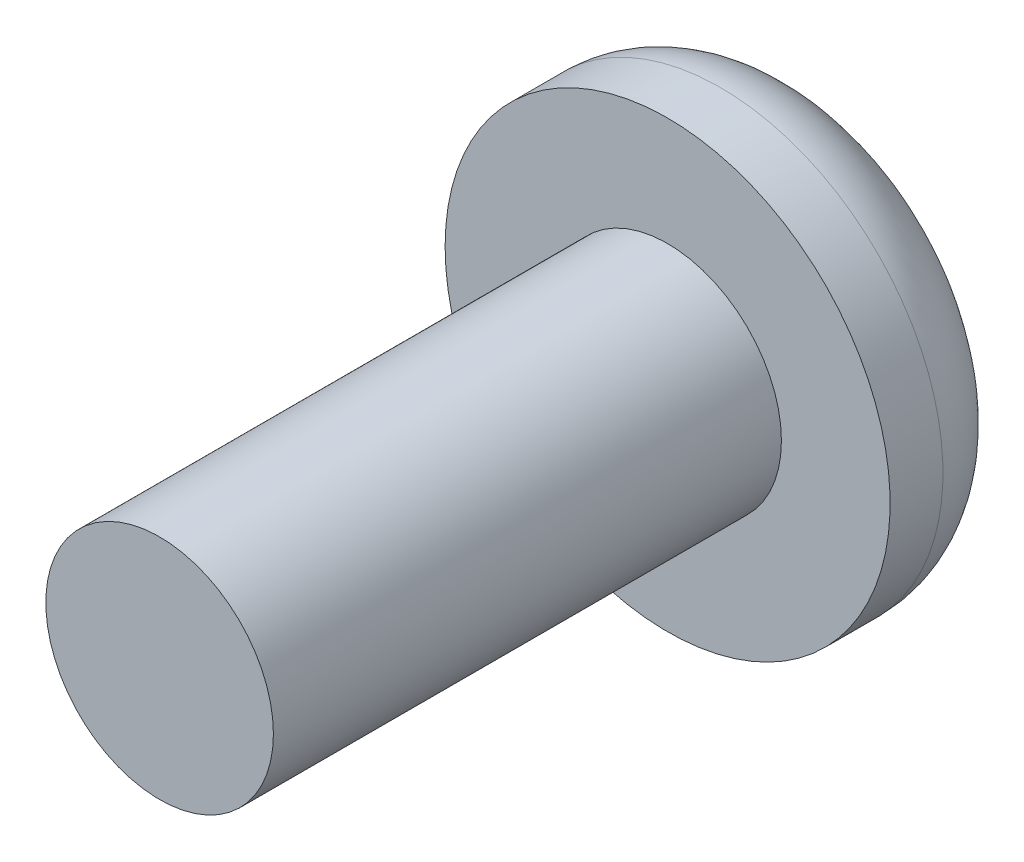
ISO-10303-21;
HEADER;
FILE_DESCRIPTION(('STEP AP214'),'2;1');
FILE_NAME('part.step','',(''),(''),'','','');
FILE_SCHEMA(('AUTOMOTIVE_DESIGN { 1 0 10303 214 1 1 1 1 }'));
ENDSEC;
DATA;
#1=APPLICATION_CONTEXT('core data for automotive mechanical design processes');
#2=APPLICATION_PROTOCOL_DEFINITION('international standard','automotive_design',2000,#1);
#3=PRODUCT_CONTEXT('',#1,'mechanical');
#4=PRODUCT('Part','Part','',(#3));
#5=PRODUCT_RELATED_PRODUCT_CATEGORY('part','',(#4));
#6=PRODUCT_DEFINITION_FORMATION('','',#4);
#7=PRODUCT_DEFINITION_CONTEXT('part definition',#1,'design');
#8=PRODUCT_DEFINITION('design','',#6,#7);
#9=PRODUCT_DEFINITION_SHAPE('','',#8);
#10=(LENGTH_UNIT() NAMED_UNIT(*) SI_UNIT(.MILLI.,.METRE.));
#11=(NAMED_UNIT(*) PLANE_ANGLE_UNIT() SI_UNIT($,.RADIAN.));
#12=(NAMED_UNIT(*) SI_UNIT($,.STERADIAN.) SOLID_ANGLE_UNIT());
#13=UNCERTAINTY_MEASURE_WITH_UNIT(LENGTH_MEASURE(1.E-05),#10,'distance_accuracy_value','');
#14=(GEOMETRIC_REPRESENTATION_CONTEXT(3) GLOBAL_UNCERTAINTY_ASSIGNED_CONTEXT((#13)) GLOBAL_UNIT_ASSIGNED_CONTEXT((#10,
#11,#12)) REPRESENTATION_CONTEXT('',''));
#15=CARTESIAN_POINT('',(0.,0.,0.));
#16=DIRECTION('',(0.,0.,1.));
#17=DIRECTION('',(1.,0.,0.));
#18=AXIS2_PLACEMENT_3D('',#15,#16,#17);
#19=CARTESIAN_POINT('',(0.,0.,-1.7272));
#20=DIRECTION('',(0.,0.,-1.));
#21=DIRECTION('',(-1.,0.,0.));
#22=AXIS2_PLACEMENT_3D('',#19,#20,#21);
#23=PLANE('',#22);
#24=CARTESIAN_POINT('',(0.,0.,-1.7272));
#25=DIRECTION('',(0.,0.,-1.));
#26=DIRECTION('',(-1.,0.,0.));
#27=AXIS2_PLACEMENT_3D('',#24,#25,#26);
#28=CIRCLE('',#27,1.7145);
#29=CARTESIAN_POINT('',(-1.7145,0.,-1.7272));
#30=VERTEX_POINT('',#29);
#31=EDGE_CURVE('E44',#30,#30,#28,.T.);
#32=ORIENTED_EDGE('',*,*,#31,.T.);
#33=EDGE_LOOP('',(#32));
#34=FACE_BOUND('',#33,.T.);
#35=DIRECTION('',(0.,-1.,0.));
#36=VECTOR('',#35,1.);
#37=CARTESIAN_POINT('',(1.4224,0.342899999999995,-1.72719999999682));
#38=LINE('',#37,#36);
#39=CARTESIAN_POINT('',(1.4224,0.342899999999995,-1.72719999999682));
#40=VERTEX_POINT('',#39);
#41=CARTESIAN_POINT('',(1.4224,-0.342900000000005,-1.72719999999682));
#42=VERTEX_POINT('',#41);
#43=EDGE_CURVE('E195',#40,#42,#38,.T.);
#44=ORIENTED_EDGE('',*,*,#43,.F.);
#45=DIRECTION('',(-1.,0.,0.));
#46=VECTOR('',#45,1.);
#47=CARTESIAN_POINT('',(1.4224,0.342899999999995,-1.72719999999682));
#48=LINE('',#47,#46);
#49=CARTESIAN_POINT('',(0.3429,0.342899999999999,-1.72719999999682));
#50=VERTEX_POINT('',#49);
#51=EDGE_CURVE('E189',#40,#50,#48,.T.);
#52=ORIENTED_EDGE('',*,*,#51,.T.);
#53=DIRECTION('',(0.,1.,0.));
#54=VECTOR('',#53,1.);
#55=CARTESIAN_POINT('',(0.3429,0.,-1.72719999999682));
#56=LINE('',#55,#54);
#57=CARTESIAN_POINT('',(0.3429,1.4224,-1.72719999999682));
#58=VERTEX_POINT('',#57);
#59=EDGE_CURVE('E64',#50,#58,#56,.T.);
#60=ORIENTED_EDGE('',*,*,#59,.T.);
#61=DIRECTION('',(1.,0.,0.));
#62=VECTOR('',#61,1.);
#63=CARTESIAN_POINT('',(-0.3429,1.4224,-1.72719999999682));
#64=LINE('',#63,#62);
#65=CARTESIAN_POINT('',(-0.3429,1.4224,-1.72719999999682));
#66=VERTEX_POINT('',#65);
#67=EDGE_CURVE('E216',#66,#58,#64,.T.);
#68=ORIENTED_EDGE('',*,*,#67,.F.);
#69=DIRECTION('',(0.,-1.,0.));
#70=VECTOR('',#69,1.);
#71=CARTESIAN_POINT('',(-0.3429,1.4224,-1.72719999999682));
#72=LINE('',#71,#70);
#73=CARTESIAN_POINT('',(-0.3429,0.342900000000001,-1.72719999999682));
#74=VERTEX_POINT('',#73);
#75=EDGE_CURVE('E210',#66,#74,#72,.T.);
#76=ORIENTED_EDGE('',*,*,#75,.T.);
#77=CARTESIAN_POINT('',(-1.4224,0.342900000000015,-1.72719999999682));
#78=VERTEX_POINT('',#77);
#79=EDGE_CURVE('E198',#74,#78,#48,.T.);
#80=ORIENTED_EDGE('',*,*,#79,.T.);
#81=DIRECTION('',(0.,1.,0.));
#82=VECTOR('',#81,1.);
#83=CARTESIAN_POINT('',(-1.4224,-0.342899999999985,-1.72719999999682));
#84=LINE('',#83,#82);
#85=CARTESIAN_POINT('',(-1.4224,-0.342899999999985,-1.72719999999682));
#86=VERTEX_POINT('',#85);
#87=EDGE_CURVE('E143',#86,#78,#84,.T.);
#88=ORIENTED_EDGE('',*,*,#87,.F.);
#89=DIRECTION('',(1.,0.,0.));
#90=VECTOR('',#89,1.);
#91=CARTESIAN_POINT('',(-1.4224,-0.342899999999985,-1.72719999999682));
#92=LINE('',#91,#90);
#93=CARTESIAN_POINT('',(-0.34290000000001,-0.342899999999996,-1.72719999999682));
#94=VERTEX_POINT('',#93);
#95=EDGE_CURVE('E154',#86,#94,#92,.T.);
#96=ORIENTED_EDGE('',*,*,#95,.T.);
#97=DIRECTION('',(0.,-1.,0.));
#98=VECTOR('',#97,1.);
#99=CARTESIAN_POINT('',(-0.3429,0.,-1.72719999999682));
#100=LINE('',#99,#98);
#101=CARTESIAN_POINT('',(-0.34290000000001,-1.4224,-1.72719999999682));
#102=VERTEX_POINT('',#101);
#103=EDGE_CURVE('E163',#94,#102,#100,.T.);
#104=ORIENTED_EDGE('',*,*,#103,.T.);
#105=DIRECTION('',(-1.,0.,0.));
#106=VECTOR('',#105,1.);
#107=CARTESIAN_POINT('',(0.34289999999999,-1.4224,-1.72719999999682));
#108=LINE('',#107,#106);
#109=CARTESIAN_POINT('',(0.34289999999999,-1.4224,-1.72719999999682));
#110=VERTEX_POINT('',#109);
#111=EDGE_CURVE('E176',#110,#102,#108,.T.);
#112=ORIENTED_EDGE('',*,*,#111,.F.);
#113=DIRECTION('',(0.,1.,0.));
#114=VECTOR('',#113,1.);
#115=CARTESIAN_POINT('',(0.34289999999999,-1.4224,-1.72719999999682));
#116=LINE('',#115,#114);
#117=CARTESIAN_POINT('',(0.342899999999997,-0.342900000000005,-1.72719999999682));
#118=VERTEX_POINT('',#117);
#119=EDGE_CURVE('E167',#110,#118,#116,.T.);
#120=ORIENTED_EDGE('',*,*,#119,.T.);
#121=DIRECTION('',(1.,0.,0.));
#122=VECTOR('',#121,1.);
#123=CARTESIAN_POINT('',(0.,-0.3429,-1.72719999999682));
#124=LINE('',#123,#122);
#125=EDGE_CURVE('E186',#118,#42,#124,.T.);
#126=ORIENTED_EDGE('',*,*,#125,.T.);
#127=EDGE_LOOP('',(#44,#52,#60,#68,#76,#80,#88,#96,#104,#112,#120,#126));
#128=FACE_BOUND('',#127,.T.);
#129=ADVANCED_FACE('F35',(#34,#128),#23,.T.);
#130=CARTESIAN_POINT('',(0.3429,0.,-0.863599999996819));
#131=DIRECTION('',(-1.,0.,0.));
#132=DIRECTION('',(0.,-1.,0.));
#133=AXIS2_PLACEMENT_3D('',#130,#131,#132);
#134=PLANE('',#133);
#135=ORIENTED_EDGE('',*,*,#59,.F.);
#136=DIRECTION('',(0.,0.,1.));
#137=VECTOR('',#136,1.);
#138=CARTESIAN_POINT('',(0.3429,0.342899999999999,-0.863599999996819));
#139=LINE('',#138,#137);
#140=CARTESIAN_POINT('',(0.3429,0.342899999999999,-0.863599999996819));
#141=VERTEX_POINT('',#140);
#142=EDGE_CURVE('E204',#50,#141,#139,.T.);
#143=ORIENTED_EDGE('',*,*,#142,.T.);
#144=DIRECTION('',(0.,1.,0.));
#145=VECTOR('',#144,1.);
#146=CARTESIAN_POINT('',(0.3429,0.,-0.863599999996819));
#147=LINE('',#146,#145);
#148=CARTESIAN_POINT('',(0.3429,1.4224,-0.863599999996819));
#149=VERTEX_POINT('',#148);
#150=EDGE_CURVE('E207',#141,#149,#147,.T.);
#151=ORIENTED_EDGE('',*,*,#150,.T.);
#152=DIRECTION('',(0.,0.,-1.));
#153=VECTOR('',#152,1.);
#154=CARTESIAN_POINT('',(0.3429,1.4224,-0.863599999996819));
#155=LINE('',#154,#153);
#156=EDGE_CURVE('E222',#149,#58,#155,.T.);
#157=ORIENTED_EDGE('',*,*,#156,.T.);
#158=EDGE_LOOP('',(#135,#143,#151,#157));
#159=FACE_BOUND('',#158,.T.);
#160=ADVANCED_FACE('F251',(#159),#134,.T.);
#161=CARTESIAN_POINT('',(-0.3429,1.4224,-0.863599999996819));
#162=DIRECTION('',(1.,0.,0.));
#163=DIRECTION('',(0.,1.,0.));
#164=AXIS2_PLACEMENT_3D('',#161,#162,#163);
#165=PLANE('',#164);
#166=DIRECTION('',(0.,-1.,0.));
#167=VECTOR('',#166,1.);
#168=CARTESIAN_POINT('',(-0.3429,1.4224,-0.863599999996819));
#169=LINE('',#168,#167);
#170=CARTESIAN_POINT('',(-0.3429,1.4224,-0.863599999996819));
#171=VERTEX_POINT('',#170);
#172=CARTESIAN_POINT('',(-0.3429,0.342900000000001,-0.863599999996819));
#173=VERTEX_POINT('',#172);
#174=EDGE_CURVE('E213',#171,#173,#169,.T.);
#175=ORIENTED_EDGE('',*,*,#174,.T.);
#176=DIRECTION('',(0.,0.,-1.));
#177=VECTOR('',#176,1.);
#178=CARTESIAN_POINT('',(-0.3429,0.342900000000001,-0.863599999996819));
#179=LINE('',#178,#177);
#180=EDGE_CURVE('E72',#173,#74,#179,.T.);
#181=ORIENTED_EDGE('',*,*,#180,.T.);
#182=ORIENTED_EDGE('',*,*,#75,.F.);
#183=DIRECTION('',(0.,0.,-1.));
#184=VECTOR('',#183,1.);
#185=CARTESIAN_POINT('',(-0.3429,1.4224,-0.863599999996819));
#186=LINE('',#185,#184);
#187=EDGE_CURVE('E52',#171,#66,#186,.T.);
#188=ORIENTED_EDGE('',*,*,#187,.F.);
#189=EDGE_LOOP('',(#175,#181,#182,#188));
#190=FACE_BOUND('',#189,.T.);
#191=ADVANCED_FACE('F256',(#190),#165,.T.);
#192=CARTESIAN_POINT('',(0.,0.,6.35));
#193=DIRECTION('',(0.,0.,-1.));
#194=DIRECTION('',(-1.,0.,0.));
#195=AXIS2_PLACEMENT_3D('',#192,#193,#194);
#196=CYLINDRICAL_SURFACE('',#195,1.4224);
#197=CARTESIAN_POINT('',(0.,0.,6.35));
#198=DIRECTION('',(0.,0.,1.));
#199=DIRECTION('',(1.,0.,0.));
#200=AXIS2_PLACEMENT_3D('',#197,#198,#199);
#201=CIRCLE('',#200,1.4224);
#202=CARTESIAN_POINT('',(1.4224,0.,6.35));
#203=VERTEX_POINT('',#202);
#204=EDGE_CURVE('E230',#203,#203,#201,.T.);
#205=ORIENTED_EDGE('',*,*,#204,.F.);
#206=EDGE_LOOP('',(#205));
#207=FACE_BOUND('',#206,.T.);
#208=CARTESIAN_POINT('',(0.,0.,0.));
#209=DIRECTION('',(0.,0.,1.));
#210=DIRECTION('',(1.,0.,0.));
#211=AXIS2_PLACEMENT_3D('',#208,#209,#210);
#212=CIRCLE('',#211,1.4224);
#213=CARTESIAN_POINT('',(1.4224,0.,0.));
#214=VERTEX_POINT('',#213);
#215=EDGE_CURVE('E227',#214,#214,#212,.T.);
#216=ORIENTED_EDGE('',*,*,#215,.T.);
#217=EDGE_LOOP('',(#216));
#218=FACE_BOUND('',#217,.T.);
#219=ADVANCED_FACE('F265',(#207,#218),#196,.T.);
#220=CARTESIAN_POINT('',(0.,0.,6.35));
#221=DIRECTION('',(0.,0.,1.));
#222=DIRECTION('',(1.,0.,0.));
#223=AXIS2_PLACEMENT_3D('',#220,#221,#222);
#224=PLANE('',#223);
#225=ORIENTED_EDGE('',*,*,#204,.T.);
#226=EDGE_LOOP('',(#225));
#227=FACE_BOUND('',#226,.T.);
#228=ADVANCED_FACE('F262',(#227),#224,.T.);
#229=CARTESIAN_POINT('',(2.7813,0.,0.));
#230=DIRECTION('',(0.,0.,1.));
#231=DIRECTION('',(1.,0.,0.));
#232=AXIS2_PLACEMENT_3D('',#229,#230,#231);
#233=PLANE('',#232);
#234=CARTESIAN_POINT('',(0.,0.,0.));
#235=DIRECTION('',(0.,0.,-1.));
#236=DIRECTION('',(-1.,0.,0.));
#237=AXIS2_PLACEMENT_3D('',#234,#235,#236);
#238=CIRCLE('',#237,2.7813);
#239=CARTESIAN_POINT('',(-2.7813,0.,0.));
#240=VERTEX_POINT('',#239);
#241=EDGE_CURVE('E224',#240,#240,#238,.T.);
#242=ORIENTED_EDGE('',*,*,#241,.F.);
#243=EDGE_LOOP('',(#242));
#244=FACE_BOUND('',#243,.T.);
#245=ORIENTED_EDGE('',*,*,#215,.F.);
#246=EDGE_LOOP('',(#245));
#247=FACE_BOUND('',#246,.T.);
#248=ADVANCED_FACE('F246',(#244,#247),#233,.T.);
#249=CARTESIAN_POINT('',(0.,0.,-4.84031750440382));
#250=DIRECTION('',(0.,0.,-1.));
#251=DIRECTION('',(-1.,0.,0.));
#252=AXIS2_PLACEMENT_3D('',#249,#250,#251);
#253=CYLINDRICAL_SURFACE('',#252,2.7813);
#254=CARTESIAN_POINT('',(0.,0.,-0.660399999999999));
#255=DIRECTION('',(0.,0.,-1.));
#256=DIRECTION('',(-1.,0.,0.));
#257=AXIS2_PLACEMENT_3D('',#254,#255,#256);
#258=CIRCLE('',#257,2.7813);
#259=CARTESIAN_POINT('',(-2.7813,0.,-0.660399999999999));
#260=VERTEX_POINT('',#259);
#261=EDGE_CURVE('E11',#260,#260,#258,.F.);
#262=ORIENTED_EDGE('',*,*,#261,.T.);
#263=EDGE_LOOP('',(#262));
#264=FACE_BOUND('',#263,.T.);
#265=ORIENTED_EDGE('',*,*,#241,.T.);
#266=EDGE_LOOP('',(#265));
#267=FACE_BOUND('',#266,.T.);
#268=ADVANCED_FACE('F238',(#264,#267),#253,.T.);
#269=CARTESIAN_POINT('',(0.,0.,-0.660399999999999));
#270=DIRECTION('',(0.,0.,-1.));
#271=DIRECTION('',(-1.,0.,0.));
#272=AXIS2_PLACEMENT_3D('',#269,#270,#271);
#273=TOROIDAL_SURFACE('',#272,1.7145,1.0668);
#274=ORIENTED_EDGE('',*,*,#261,.F.);
#275=EDGE_LOOP('',(#274));
#276=FACE_BOUND('',#275,.T.);
#277=ORIENTED_EDGE('',*,*,#31,.F.);
#278=EDGE_LOOP('',(#277));
#279=FACE_BOUND('',#278,.T.);
#280=ADVANCED_FACE('F37',(#276,#279),#273,.T.);
#281=CARTESIAN_POINT('',(-0.3429,1.4224,-0.863599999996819));
#282=DIRECTION('',(0.,1.,0.));
#283=DIRECTION('',(0.,0.,1.));
#284=AXIS2_PLACEMENT_3D('',#281,#282,#283);
#285=PLANE('',#284);
#286=ORIENTED_EDGE('',*,*,#67,.T.);
#287=ORIENTED_EDGE('',*,*,#156,.F.);
#288=DIRECTION('',(1.,0.,0.));
#289=VECTOR('',#288,1.);
#290=CARTESIAN_POINT('',(-0.3429,1.4224,-0.863599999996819));
#291=LINE('',#290,#289);
#292=EDGE_CURVE('E209',#171,#149,#291,.T.);
#293=ORIENTED_EDGE('',*,*,#292,.F.);
#294=ORIENTED_EDGE('',*,*,#187,.T.);
#295=EDGE_LOOP('',(#286,#287,#293,#294));
#296=FACE_BOUND('',#295,.T.);
#297=ADVANCED_FACE('F237',(#296),#285,.F.);
#298=CARTESIAN_POINT('',(0.3429,0.,-0.863599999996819));
#299=DIRECTION('',(0.,0.,1.));
#300=DIRECTION('',(1.,0.,0.));
#301=AXIS2_PLACEMENT_3D('',#298,#299,#300);
#302=PLANE('',#301);
#303=ORIENTED_EDGE('',*,*,#150,.F.);
#304=DIRECTION('',(-1.,0.,0.));
#305=VECTOR('',#304,1.);
#306=CARTESIAN_POINT('',(1.4224,0.342899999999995,-0.863599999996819));
#307=LINE('',#306,#305);
#308=CARTESIAN_POINT('',(1.4224,0.342899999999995,-0.863599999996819));
#309=VERTEX_POINT('',#308);
#310=EDGE_CURVE('E135',#309,#141,#307,.T.);
#311=ORIENTED_EDGE('',*,*,#310,.F.);
#312=DIRECTION('',(0.,-1.,0.));
#313=VECTOR('',#312,1.);
#314=CARTESIAN_POINT('',(1.4224,0.342899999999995,-0.863599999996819));
#315=LINE('',#314,#313);
#316=CARTESIAN_POINT('',(1.4224,-0.342900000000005,-0.863599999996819));
#317=VERTEX_POINT('',#316);
#318=EDGE_CURVE('E136',#309,#317,#315,.T.);
#319=ORIENTED_EDGE('',*,*,#318,.T.);
#320=DIRECTION('',(1.,0.,0.));
#321=VECTOR('',#320,1.);
#322=CARTESIAN_POINT('',(0.,-0.3429,-0.863599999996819));
#323=LINE('',#322,#321);
#324=CARTESIAN_POINT('',(0.342899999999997,-0.342900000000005,-0.863599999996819));
#325=VERTEX_POINT('',#324);
#326=EDGE_CURVE('E187',#325,#317,#323,.T.);
#327=ORIENTED_EDGE('',*,*,#326,.F.);
#328=DIRECTION('',(0.,1.,0.));
#329=VECTOR('',#328,1.);
#330=CARTESIAN_POINT('',(0.34289999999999,-1.4224,-0.863599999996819));
#331=LINE('',#330,#329);
#332=CARTESIAN_POINT('',(0.34289999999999,-1.4224,-0.863599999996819));
#333=VERTEX_POINT('',#332);
#334=EDGE_CURVE('E170',#333,#325,#331,.T.);
#335=ORIENTED_EDGE('',*,*,#334,.F.);
#336=DIRECTION('',(-1.,0.,0.));
#337=VECTOR('',#336,1.);
#338=CARTESIAN_POINT('',(0.34289999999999,-1.4224,-0.863599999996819));
#339=LINE('',#338,#337);
#340=CARTESIAN_POINT('',(-0.34290000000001,-1.4224,-0.863599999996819));
#341=VERTEX_POINT('',#340);
#342=EDGE_CURVE('E166',#333,#341,#339,.T.);
#343=ORIENTED_EDGE('',*,*,#342,.T.);
#344=DIRECTION('',(0.,-1.,0.));
#345=VECTOR('',#344,1.);
#346=CARTESIAN_POINT('',(-0.3429,0.,-0.863599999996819));
#347=LINE('',#346,#345);
#348=CARTESIAN_POINT('',(-0.34290000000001,-0.342899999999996,-0.863599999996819));
#349=VERTEX_POINT('',#348);
#350=EDGE_CURVE('E164',#349,#341,#347,.T.);
#351=ORIENTED_EDGE('',*,*,#350,.F.);
#352=DIRECTION('',(1.,0.,0.));
#353=VECTOR('',#352,1.);
#354=CARTESIAN_POINT('',(-1.4224,-0.342899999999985,-0.863599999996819));
#355=LINE('',#354,#353);
#356=CARTESIAN_POINT('',(-1.4224,-0.342899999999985,-0.863599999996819));
#357=VERTEX_POINT('',#356);
#358=EDGE_CURVE('E153',#357,#349,#355,.T.);
#359=ORIENTED_EDGE('',*,*,#358,.F.);
#360=DIRECTION('',(0.,1.,0.));
#361=VECTOR('',#360,1.);
#362=CARTESIAN_POINT('',(-1.4224,-0.342899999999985,-0.863599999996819));
#363=LINE('',#362,#361);
#364=CARTESIAN_POINT('',(-1.4224,0.342900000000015,-0.863599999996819));
#365=VERTEX_POINT('',#364);
#366=EDGE_CURVE('E141',#357,#365,#363,.T.);
#367=ORIENTED_EDGE('',*,*,#366,.T.);
#368=EDGE_CURVE('E128',#173,#365,#307,.T.);
#369=ORIENTED_EDGE('',*,*,#368,.F.);
#370=ORIENTED_EDGE('',*,*,#174,.F.);
#371=ORIENTED_EDGE('',*,*,#292,.T.);
#372=EDGE_LOOP('',(#303,#311,#319,#327,#335,#343,#351,#359,#367,#369,#370,#371));
#373=FACE_BOUND('',#372,.T.);
#374=ADVANCED_FACE('F150',(#373),#302,.F.);
#375=CARTESIAN_POINT('',(1.4224,0.342899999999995,-0.863599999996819));
#376=DIRECTION('',(0.,-1.,0.));
#377=DIRECTION('',(1.,0.,0.));
#378=AXIS2_PLACEMENT_3D('',#375,#376,#377);
#379=PLANE('',#378);
#380=ORIENTED_EDGE('',*,*,#51,.F.);
#381=DIRECTION('',(0.,0.,-1.));
#382=VECTOR('',#381,1.);
#383=CARTESIAN_POINT('',(1.4224,0.342899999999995,-0.863599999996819));
#384=LINE('',#383,#382);
#385=EDGE_CURVE('E192',#309,#40,#384,.T.);
#386=ORIENTED_EDGE('',*,*,#385,.F.);
#387=ORIENTED_EDGE('',*,*,#310,.T.);
#388=ORIENTED_EDGE('',*,*,#142,.F.);
#389=EDGE_LOOP('',(#380,#386,#387,#388));
#390=FACE_BOUND('',#389,.T.);
#391=ADVANCED_FACE('F282',(#390),#379,.T.);
#392=CARTESIAN_POINT('',(0.,-0.3429,-0.863599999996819));
#393=DIRECTION('',(0.,1.,0.));
#394=DIRECTION('',(-1.,0.,0.));
#395=AXIS2_PLACEMENT_3D('',#392,#393,#394);
#396=PLANE('',#395);
#397=DIRECTION('',(0.,0.,1.));
#398=VECTOR('',#397,1.);
#399=CARTESIAN_POINT('',(0.342899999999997,-0.342900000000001,-0.863599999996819));
#400=LINE('',#399,#398);
#401=EDGE_CURVE('E184',#118,#325,#400,.T.);
#402=ORIENTED_EDGE('',*,*,#401,.T.);
#403=ORIENTED_EDGE('',*,*,#326,.T.);
#404=DIRECTION('',(0.,0.,-1.));
#405=VECTOR('',#404,1.);
#406=CARTESIAN_POINT('',(1.4224,-0.342900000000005,-0.863599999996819));
#407=LINE('',#406,#405);
#408=EDGE_CURVE('E201',#317,#42,#407,.T.);
#409=ORIENTED_EDGE('',*,*,#408,.T.);
#410=ORIENTED_EDGE('',*,*,#125,.F.);
#411=EDGE_LOOP('',(#402,#403,#409,#410));
#412=FACE_BOUND('',#411,.T.);
#413=ADVANCED_FACE('F283',(#412),#396,.T.);
#414=CARTESIAN_POINT('',(1.4224,0.342899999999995,-0.863599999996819));
#415=DIRECTION('',(1.,0.,0.));
#416=DIRECTION('',(0.,1.,0.));
#417=AXIS2_PLACEMENT_3D('',#414,#415,#416);
#418=PLANE('',#417);
#419=ORIENTED_EDGE('',*,*,#43,.T.);
#420=ORIENTED_EDGE('',*,*,#408,.F.);
#421=ORIENTED_EDGE('',*,*,#318,.F.);
#422=ORIENTED_EDGE('',*,*,#385,.T.);
#423=EDGE_LOOP('',(#419,#420,#421,#422));
#424=FACE_BOUND('',#423,.T.);
#425=ADVANCED_FACE('F286',(#424),#418,.F.);
#426=ORIENTED_EDGE('',*,*,#368,.T.);
#427=DIRECTION('',(0.,0.,-1.));
#428=VECTOR('',#427,1.);
#429=CARTESIAN_POINT('',(-1.4224,0.342900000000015,-0.863599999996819));
#430=LINE('',#429,#428);
#431=EDGE_CURVE('E131',#365,#78,#430,.T.);
#432=ORIENTED_EDGE('',*,*,#431,.T.);
#433=ORIENTED_EDGE('',*,*,#79,.F.);
#434=ORIENTED_EDGE('',*,*,#180,.F.);
#435=EDGE_LOOP('',(#426,#432,#433,#434));
#436=FACE_BOUND('',#435,.T.);
#437=ADVANCED_FACE('F130',(#436),#379,.T.);
#438=CARTESIAN_POINT('',(0.34289999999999,-1.4224,-0.863599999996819));
#439=DIRECTION('',(-1.,0.,0.));
#440=DIRECTION('',(0.,-1.,0.));
#441=AXIS2_PLACEMENT_3D('',#438,#439,#440);
#442=PLANE('',#441);
#443=ORIENTED_EDGE('',*,*,#119,.F.);
#444=DIRECTION('',(0.,0.,-1.));
#445=VECTOR('',#444,1.);
#446=CARTESIAN_POINT('',(0.34289999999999,-1.4224,-0.863599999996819));
#447=LINE('',#446,#445);
#448=EDGE_CURVE('E173',#333,#110,#447,.T.);
#449=ORIENTED_EDGE('',*,*,#448,.F.);
#450=ORIENTED_EDGE('',*,*,#334,.T.);
#451=ORIENTED_EDGE('',*,*,#401,.F.);
#452=EDGE_LOOP('',(#443,#449,#450,#451));
#453=FACE_BOUND('',#452,.T.);
#454=ADVANCED_FACE('F293',(#453),#442,.T.);
#455=CARTESIAN_POINT('',(-0.3429,0.,-0.863599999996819));
#456=DIRECTION('',(1.,0.,0.));
#457=DIRECTION('',(0.,1.,0.));
#458=AXIS2_PLACEMENT_3D('',#455,#456,#457);
#459=PLANE('',#458);
#460=DIRECTION('',(0.,0.,1.));
#461=VECTOR('',#460,1.);
#462=CARTESIAN_POINT('',(-0.342900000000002,-0.342899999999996,-0.863599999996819));
#463=LINE('',#462,#461);
#464=EDGE_CURVE('E145',#94,#349,#463,.T.);
#465=ORIENTED_EDGE('',*,*,#464,.T.);
#466=ORIENTED_EDGE('',*,*,#350,.T.);
#467=DIRECTION('',(0.,0.,-1.));
#468=VECTOR('',#467,1.);
#469=CARTESIAN_POINT('',(-0.34290000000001,-1.4224,-0.863599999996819));
#470=LINE('',#469,#468);
#471=EDGE_CURVE('E182',#341,#102,#470,.T.);
#472=ORIENTED_EDGE('',*,*,#471,.T.);
#473=ORIENTED_EDGE('',*,*,#103,.F.);
#474=EDGE_LOOP('',(#465,#466,#472,#473));
#475=FACE_BOUND('',#474,.T.);
#476=ADVANCED_FACE('F294',(#475),#459,.T.);
#477=CARTESIAN_POINT('',(0.34289999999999,-1.4224,-0.863599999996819));
#478=DIRECTION('',(0.,-1.,0.));
#479=DIRECTION('',(1.,0.,0.));
#480=AXIS2_PLACEMENT_3D('',#477,#478,#479);
#481=PLANE('',#480);
#482=ORIENTED_EDGE('',*,*,#111,.T.);
#483=ORIENTED_EDGE('',*,*,#471,.F.);
#484=ORIENTED_EDGE('',*,*,#342,.F.);
#485=ORIENTED_EDGE('',*,*,#448,.T.);
#486=EDGE_LOOP('',(#482,#483,#484,#485));
#487=FACE_BOUND('',#486,.T.);
#488=ADVANCED_FACE('F297',(#487),#481,.F.);
#489=CARTESIAN_POINT('',(-1.4224,-0.342899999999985,-0.863599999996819));
#490=DIRECTION('',(0.,1.,0.));
#491=DIRECTION('',(-1.,0.,0.));
#492=AXIS2_PLACEMENT_3D('',#489,#490,#491);
#493=PLANE('',#492);
#494=ORIENTED_EDGE('',*,*,#95,.F.);
#495=DIRECTION('',(0.,0.,-1.));
#496=VECTOR('',#495,1.);
#497=CARTESIAN_POINT('',(-1.4224,-0.342899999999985,-0.863599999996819));
#498=LINE('',#497,#496);
#499=EDGE_CURVE('E146',#357,#86,#498,.T.);
#500=ORIENTED_EDGE('',*,*,#499,.F.);
#501=ORIENTED_EDGE('',*,*,#358,.T.);
#502=ORIENTED_EDGE('',*,*,#464,.F.);
#503=EDGE_LOOP('',(#494,#500,#501,#502));
#504=FACE_BOUND('',#503,.T.);
#505=ADVANCED_FACE('F301',(#504),#493,.T.);
#506=CARTESIAN_POINT('',(-1.4224,-0.342899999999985,-0.863599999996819));
#507=DIRECTION('',(-1.,0.,0.));
#508=DIRECTION('',(0.,-1.,0.));
#509=AXIS2_PLACEMENT_3D('',#506,#507,#508);
#510=PLANE('',#509);
#511=ORIENTED_EDGE('',*,*,#87,.T.);
#512=ORIENTED_EDGE('',*,*,#431,.F.);
#513=ORIENTED_EDGE('',*,*,#366,.F.);
#514=ORIENTED_EDGE('',*,*,#499,.T.);
#515=EDGE_LOOP('',(#511,#512,#513,#514));
#516=FACE_BOUND('',#515,.T.);
#517=ADVANCED_FACE('F140',(#516),#510,.F.);
#518=CLOSED_SHELL('',(#129,#160,#191,#219,#228,#248,#268,#280,#297,#374,#391,#413,#425,#437,
#454,#476,#488,#505,#517));
#519=MANIFOLD_SOLID_BREP('B2',#518);
#520=ADVANCED_BREP_SHAPE_REPRESENTATION('',(#18,#519),#14);
#521=SHAPE_DEFINITION_REPRESENTATION(#9,#520);
ENDSEC;
END-ISO-10303-21;
